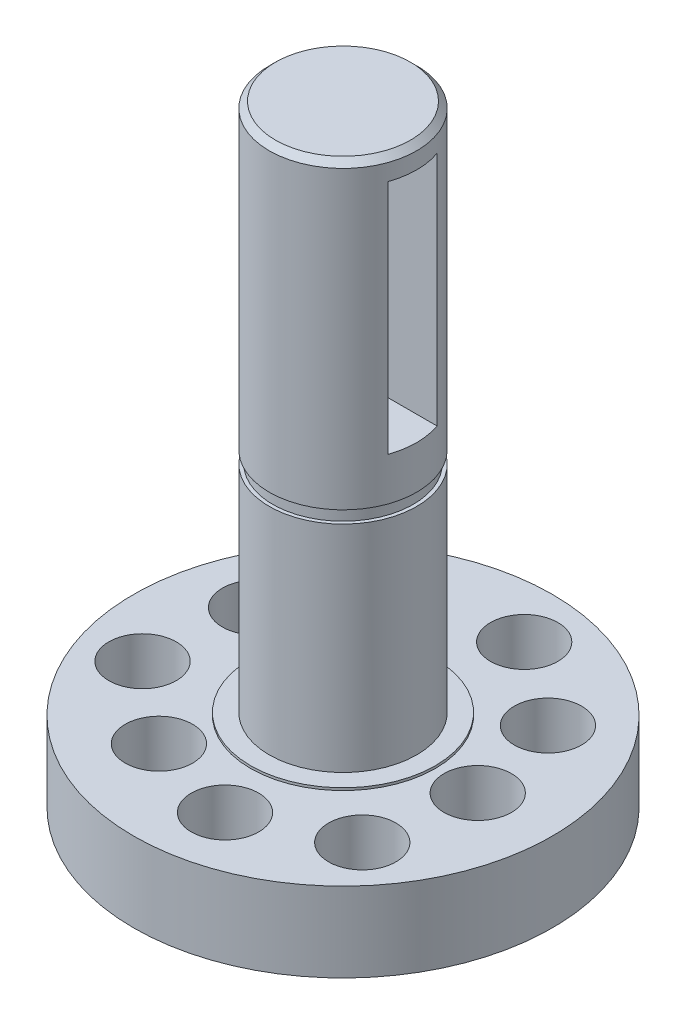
ISO-10303-21;
HEADER;
FILE_DESCRIPTION(('STEP AP214'),'2;1');
FILE_NAME('part.step','',(''),(''),'','','');
FILE_SCHEMA(('AUTOMOTIVE_DESIGN { 1 0 10303 214 1 1 1 1 }'));
ENDSEC;
DATA;
#1=APPLICATION_CONTEXT('core data for automotive mechanical design processes');
#2=APPLICATION_PROTOCOL_DEFINITION('international standard','automotive_design',2000,#1);
#3=PRODUCT_CONTEXT('',#1,'mechanical');
#4=PRODUCT('Part','Part','',(#3));
#5=PRODUCT_RELATED_PRODUCT_CATEGORY('part','',(#4));
#6=PRODUCT_DEFINITION_FORMATION('','',#4);
#7=PRODUCT_DEFINITION_CONTEXT('part definition',#1,'design');
#8=PRODUCT_DEFINITION('design','',#6,#7);
#9=PRODUCT_DEFINITION_SHAPE('','',#8);
#10=(LENGTH_UNIT() NAMED_UNIT(*) SI_UNIT(.MILLI.,.METRE.));
#11=(NAMED_UNIT(*) PLANE_ANGLE_UNIT() SI_UNIT($,.RADIAN.));
#12=(NAMED_UNIT(*) SI_UNIT($,.STERADIAN.) SOLID_ANGLE_UNIT());
#13=UNCERTAINTY_MEASURE_WITH_UNIT(LENGTH_MEASURE(1.E-05),#10,'distance_accuracy_value','');
#14=(GEOMETRIC_REPRESENTATION_CONTEXT(3) GLOBAL_UNCERTAINTY_ASSIGNED_CONTEXT((#13)) GLOBAL_UNIT_ASSIGNED_CONTEXT((#10,
#11,#12)) REPRESENTATION_CONTEXT('',''));
#15=CARTESIAN_POINT('',(0.,0.,0.));
#16=DIRECTION('',(0.,0.,1.));
#17=DIRECTION('',(1.,0.,0.));
#18=AXIS2_PLACEMENT_3D('',#15,#16,#17);
#19=CARTESIAN_POINT('',(0.,49.64,0.));
#20=DIRECTION('',(0.,-1.,0.));
#21=DIRECTION('',(0.,0.,-1.));
#22=AXIS2_PLACEMENT_3D('',#19,#20,#21);
#23=CYLINDRICAL_SURFACE('',#22,5.985);
#24=CARTESIAN_POINT('',(0.,25.13,0.));
#25=DIRECTION('',(0.,1.,0.));
#26=DIRECTION('',(0.,0.,1.));
#27=AXIS2_PLACEMENT_3D('',#24,#25,#26);
#28=CIRCLE('',#27,5.985);
#29=CARTESIAN_POINT('',(0.,25.13,5.985));
#30=VERTEX_POINT('',#29);
#31=EDGE_CURVE('E136',#30,#30,#28,.T.);
#32=ORIENTED_EDGE('',*,*,#31,.T.);
#33=EDGE_LOOP('',(#32));
#34=FACE_BOUND('',#33,.T.);
#35=CARTESIAN_POINT('',(0.,49.14,0.));
#36=DIRECTION('',(0.,1.,0.));
#37=DIRECTION('',(0.,0.,1.));
#38=AXIS2_PLACEMENT_3D('',#35,#36,#37);
#39=CIRCLE('',#38,5.985);
#40=CARTESIAN_POINT('',(0.,49.14,5.985));
#41=VERTEX_POINT('',#40);
#42=EDGE_CURVE('E166',#41,#41,#39,.F.);
#43=ORIENTED_EDGE('',*,*,#42,.T.);
#44=EDGE_LOOP('',(#43));
#45=FACE_BOUND('',#44,.T.);
#46=DIRECTION('',(0.,-1.,0.));
#47=VECTOR('',#46,1.);
#48=CARTESIAN_POINT('',(5.64310090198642,49.64,1.99390000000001));
#49=LINE('',#48,#47);
#50=CARTESIAN_POINT('',(5.64310090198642,47.7985,1.99390000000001));
#51=VERTEX_POINT('',#50);
#52=CARTESIAN_POINT('',(5.64310090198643,28.6215,1.9939));
#53=VERTEX_POINT('',#52);
#54=EDGE_CURVE('E11',#51,#53,#49,.T.);
#55=ORIENTED_EDGE('',*,*,#54,.F.);
#56=CARTESIAN_POINT('',(0.,47.7985,0.));
#57=DIRECTION('',(0.,-1.,0.));
#58=DIRECTION('',(0.,0.,-1.));
#59=AXIS2_PLACEMENT_3D('',#56,#57,#58);
#60=CIRCLE('',#59,5.985);
#61=CARTESIAN_POINT('',(5.64310090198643,47.7985,-1.99389999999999));
#62=VERTEX_POINT('',#61);
#63=EDGE_CURVE('E223',#62,#51,#60,.T.);
#64=ORIENTED_EDGE('',*,*,#63,.F.);
#65=DIRECTION('',(0.,-1.,0.));
#66=VECTOR('',#65,1.);
#67=CARTESIAN_POINT('',(5.64310090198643,49.64,-1.99389999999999));
#68=LINE('',#67,#66);
#69=CARTESIAN_POINT('',(5.64310090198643,28.6215,-1.9939));
#70=VERTEX_POINT('',#69);
#71=EDGE_CURVE('E225',#70,#62,#68,.F.);
#72=ORIENTED_EDGE('',*,*,#71,.F.);
#73=CARTESIAN_POINT('',(0.,28.6215,0.));
#74=DIRECTION('',(0.,1.,0.));
#75=DIRECTION('',(0.,0.,1.));
#76=AXIS2_PLACEMENT_3D('',#73,#74,#75);
#77=CIRCLE('',#76,5.985);
#78=EDGE_CURVE('E44',#53,#70,#77,.T.);
#79=ORIENTED_EDGE('',*,*,#78,.F.);
#80=EDGE_LOOP('',(#55,#64,#72,#79));
#81=FACE_BOUND('',#80,.T.);
#82=ADVANCED_FACE('F36',(#34,#45,#81),#23,.T.);
#83=CARTESIAN_POINT('',(0.,24.13,0.));
#84=DIRECTION('',(0.,-1.,0.));
#85=DIRECTION('',(0.,0.,-1.));
#86=AXIS2_PLACEMENT_3D('',#83,#84,#85);
#87=CIRCLE('',#86,5.985);
#88=CARTESIAN_POINT('',(0.,24.13,-5.985));
#89=VERTEX_POINT('',#88);
#90=EDGE_CURVE('E141',#89,#89,#87,.T.);
#91=ORIENTED_EDGE('',*,*,#90,.T.);
#92=EDGE_LOOP('',(#91));
#93=FACE_BOUND('',#92,.T.);
#94=CARTESIAN_POINT('',(0.,6.66,0.));
#95=DIRECTION('',(0.,1.,0.));
#96=DIRECTION('',(0.,0.,1.));
#97=AXIS2_PLACEMENT_3D('',#94,#95,#96);
#98=CIRCLE('',#97,5.985);
#99=CARTESIAN_POINT('',(0.,6.66,5.985));
#100=VERTEX_POINT('',#99);
#101=EDGE_CURVE('E144',#100,#100,#98,.T.);
#102=ORIENTED_EDGE('',*,*,#101,.T.);
#103=EDGE_LOOP('',(#102));
#104=FACE_BOUND('',#103,.T.);
#105=ADVANCED_FACE('F241',(#93,#104),#23,.T.);
#106=CARTESIAN_POINT('',(0.,6.46,0.));
#107=DIRECTION('',(0.,1.,0.));
#108=DIRECTION('',(0.,0.,1.));
#109=AXIS2_PLACEMENT_3D('',#106,#107,#108);
#110=PLANE('',#109);
#111=CARTESIAN_POINT('',(2.20533185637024,6.46,-12.507058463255));
#112=DIRECTION('',(0.,1.,0.));
#113=DIRECTION('',(0.,0.,1.));
#114=AXIS2_PLACEMENT_3D('',#111,#112,#113);
#115=CIRCLE('',#114,2.73685);
#116=CARTESIAN_POINT('',(2.20533185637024,6.46,-9.770208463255));
#117=VERTEX_POINT('',#116);
#118=EDGE_CURVE('E81',#117,#117,#115,.T.);
#119=ORIENTED_EDGE('',*,*,#118,.F.);
#120=EDGE_LOOP('',(#119));
#121=FACE_BOUND('',#120,.T.);
#122=CARTESIAN_POINT('',(-11.9340962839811,6.46,4.34365582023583));
#123=DIRECTION('',(0.,1.,0.));
#124=DIRECTION('',(0.,0.,1.));
#125=AXIS2_PLACEMENT_3D('',#122,#123,#124);
#126=CIRCLE('',#125,2.73685);
#127=CARTESIAN_POINT('',(-11.9340962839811,6.46,7.08050582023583));
#128=VERTEX_POINT('',#127);
#129=EDGE_CURVE('E106',#128,#128,#126,.T.);
#130=ORIENTED_EDGE('',*,*,#129,.F.);
#131=EDGE_LOOP('',(#130));
#132=FACE_BOUND('',#131,.T.);
#133=CARTESIAN_POINT('',(9.72876442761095,6.46,8.16340264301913));
#134=DIRECTION('',(0.,1.,0.));
#135=DIRECTION('',(0.,0.,1.));
#136=AXIS2_PLACEMENT_3D('',#133,#134,#135);
#137=CIRCLE('',#136,2.73685);
#138=CARTESIAN_POINT('',(9.72876442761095,6.46,10.9002526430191));
#139=VERTEX_POINT('',#138);
#140=EDGE_CURVE('E109',#139,#139,#137,.T.);
#141=ORIENTED_EDGE('',*,*,#140,.F.);
#142=EDGE_LOOP('',(#141));
#143=FACE_BOUND('',#142,.T.);
#144=CARTESIAN_POINT('',(9.04775091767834,6.46,-7.59196445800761));
#145=DIRECTION('',(0.,1.,0.));
#146=DIRECTION('',(0.,0.,1.));
#147=AXIS2_PLACEMENT_3D('',#144,#145,#146);
#148=CIRCLE('',#147,2.73685);
#149=CARTESIAN_POINT('',(9.04775091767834,6.46,-4.85511445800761));
#150=VERTEX_POINT('',#149);
#151=EDGE_CURVE('E112',#150,#150,#148,.T.);
#152=ORIENTED_EDGE('',*,*,#151,.F.);
#153=EDGE_LOOP('',(#152));
#154=FACE_BOUND('',#153,.T.);
#155=CARTESIAN_POINT('',(-11.0987095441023,6.46,-4.03959991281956));
#156=DIRECTION('',(0.,1.,0.));
#157=DIRECTION('',(0.,0.,1.));
#158=AXIS2_PLACEMENT_3D('',#155,#156,#157);
#159=CIRCLE('',#158,2.73685);
#160=CARTESIAN_POINT('',(-11.0987095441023,6.46,-1.30274991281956));
#161=VERTEX_POINT('',#160);
#162=EDGE_CURVE('E115',#161,#161,#159,.T.);
#163=ORIENTED_EDGE('',*,*,#162,.F.);
#164=EDGE_LOOP('',(#163));
#165=FACE_BOUND('',#164,.T.);
#166=CARTESIAN_POINT('',(2.05095862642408,6.46,11.6315643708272));
#167=DIRECTION('',(0.,1.,0.));
#168=DIRECTION('',(0.,0.,1.));
#169=AXIS2_PLACEMENT_3D('',#166,#167,#168);
#170=CIRCLE('',#169,2.73685);
#171=CARTESIAN_POINT('',(2.05095862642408,6.46,14.3684143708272));
#172=VERTEX_POINT('',#171);
#173=EDGE_CURVE('E118',#172,#172,#170,.T.);
#174=ORIENTED_EDGE('',*,*,#173,.F.);
#175=EDGE_LOOP('',(#174));
#176=FACE_BOUND('',#175,.T.);
#177=CARTESIAN_POINT('',(-5.47052499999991,6.46,-9.47522724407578));
#178=DIRECTION('',(0.,1.,0.));
#179=DIRECTION('',(0.,0.,1.));
#180=AXIS2_PLACEMENT_3D('',#177,#178,#179);
#181=CIRCLE('',#180,2.73685);
#182=CARTESIAN_POINT('',(-5.47052499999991,6.46,-6.73837724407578));
#183=VERTEX_POINT('',#182);
#184=EDGE_CURVE('E121',#183,#183,#181,.T.);
#185=ORIENTED_EDGE('',*,*,#184,.F.);
#186=EDGE_LOOP('',(#185));
#187=FACE_BOUND('',#186,.T.);
#188=CARTESIAN_POINT('',(-5.47052500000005,6.46,9.47522724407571));
#189=DIRECTION('',(0.,1.,0.));
#190=DIRECTION('',(0.,0.,1.));
#191=AXIS2_PLACEMENT_3D('',#188,#189,#190);
#192=CIRCLE('',#191,2.73685);
#193=CARTESIAN_POINT('',(-5.47052500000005,6.46,12.2120772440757));
#194=VERTEX_POINT('',#193);
#195=EDGE_CURVE('E124',#194,#194,#192,.T.);
#196=ORIENTED_EDGE('',*,*,#195,.F.);
#197=EDGE_LOOP('',(#196));
#198=FACE_BOUND('',#197,.T.);
#199=CARTESIAN_POINT('',(10.94105,6.46,0.));
#200=DIRECTION('',(0.,1.,0.));
#201=DIRECTION('',(0.,0.,1.));
#202=AXIS2_PLACEMENT_3D('',#199,#200,#201);
#203=CIRCLE('',#202,2.73685);
#204=CARTESIAN_POINT('',(10.94105,6.46,2.73685));
#205=VERTEX_POINT('',#204);
#206=EDGE_CURVE('E127',#205,#205,#203,.T.);
#207=ORIENTED_EDGE('',*,*,#206,.F.);
#208=EDGE_LOOP('',(#207));
#209=FACE_BOUND('',#208,.T.);
#210=CARTESIAN_POINT('',(0.,6.46,0.));
#211=DIRECTION('',(0.,1.,0.));
#212=DIRECTION('',(0.,0.,1.));
#213=AXIS2_PLACEMENT_3D('',#210,#211,#212);
#214=CIRCLE('',#213,17.);
#215=CARTESIAN_POINT('',(0.,6.46,17.));
#216=VERTEX_POINT('',#215);
#217=EDGE_CURVE('E154',#216,#216,#214,.T.);
#218=ORIENTED_EDGE('',*,*,#217,.T.);
#219=EDGE_LOOP('',(#218));
#220=FACE_BOUND('',#219,.T.);
#221=CARTESIAN_POINT('',(0.,6.46,0.));
#222=DIRECTION('',(0.,1.,0.));
#223=DIRECTION('',(0.,0.,1.));
#224=AXIS2_PLACEMENT_3D('',#221,#222,#223);
#225=CIRCLE('',#224,7.5);
#226=CARTESIAN_POINT('',(0.,6.46,7.5));
#227=VERTEX_POINT('',#226);
#228=EDGE_CURVE('E137',#227,#227,#225,.T.);
#229=ORIENTED_EDGE('',*,*,#228,.F.);
#230=EDGE_LOOP('',(#229));
#231=FACE_BOUND('',#230,.T.);
#232=ADVANCED_FACE('F247',(#121,#132,#143,#154,#165,#176,#187,#198,#209,#220,#231),#110,.T.);
#233=CARTESIAN_POINT('',(0.,6.46,0.));
#234=DIRECTION('',(0.,-1.,0.));
#235=DIRECTION('',(0.,0.,-1.));
#236=AXIS2_PLACEMENT_3D('',#233,#234,#235);
#237=CYLINDRICAL_SURFACE('',#236,17.);
#238=ORIENTED_EDGE('',*,*,#217,.F.);
#239=EDGE_LOOP('',(#238));
#240=FACE_BOUND('',#239,.T.);
#241=CARTESIAN_POINT('',(0.,0.,0.));
#242=DIRECTION('',(0.,1.,0.));
#243=DIRECTION('',(0.,0.,1.));
#244=AXIS2_PLACEMENT_3D('',#241,#242,#243);
#245=CIRCLE('',#244,17.);
#246=CARTESIAN_POINT('',(0.,0.,17.));
#247=VERTEX_POINT('',#246);
#248=EDGE_CURVE('E151',#247,#247,#245,.T.);
#249=ORIENTED_EDGE('',*,*,#248,.T.);
#250=EDGE_LOOP('',(#249));
#251=FACE_BOUND('',#250,.T.);
#252=ADVANCED_FACE('F38',(#240,#251),#237,.T.);
#253=CARTESIAN_POINT('',(0.,0.,0.));
#254=DIRECTION('',(0.,1.,0.));
#255=DIRECTION('',(0.,0.,1.));
#256=AXIS2_PLACEMENT_3D('',#253,#254,#255);
#257=PLANE('',#256);
#258=CARTESIAN_POINT('',(-11.0987095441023,0.,-4.03959991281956));
#259=DIRECTION('',(0.,1.,0.));
#260=DIRECTION('',(0.,0.,1.));
#261=AXIS2_PLACEMENT_3D('',#258,#259,#260);
#262=CIRCLE('',#261,2.99084999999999);
#263=CARTESIAN_POINT('',(-11.0987095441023,0.,-1.04874991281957));
#264=VERTEX_POINT('',#263);
#265=EDGE_CURVE('E196',#264,#264,#262,.T.);
#266=ORIENTED_EDGE('',*,*,#265,.T.);
#267=EDGE_LOOP('',(#266));
#268=FACE_BOUND('',#267,.T.);
#269=CARTESIAN_POINT('',(-5.47052499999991,0.,-9.47522724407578));
#270=DIRECTION('',(0.,1.,0.));
#271=DIRECTION('',(0.,0.,1.));
#272=AXIS2_PLACEMENT_3D('',#269,#270,#271);
#273=CIRCLE('',#272,2.99085000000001);
#274=CARTESIAN_POINT('',(-5.47052499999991,0.,-6.48437724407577));
#275=VERTEX_POINT('',#274);
#276=EDGE_CURVE('E193',#275,#275,#273,.T.);
#277=ORIENTED_EDGE('',*,*,#276,.T.);
#278=EDGE_LOOP('',(#277));
#279=FACE_BOUND('',#278,.T.);
#280=CARTESIAN_POINT('',(2.20533185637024,0.,-12.507058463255));
#281=DIRECTION('',(0.,1.,0.));
#282=DIRECTION('',(0.,0.,1.));
#283=AXIS2_PLACEMENT_3D('',#280,#281,#282);
#284=CIRCLE('',#283,2.99085000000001);
#285=CARTESIAN_POINT('',(2.20533185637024,0.,-9.516208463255));
#286=VERTEX_POINT('',#285);
#287=EDGE_CURVE('E190',#286,#286,#284,.T.);
#288=ORIENTED_EDGE('',*,*,#287,.T.);
#289=EDGE_LOOP('',(#288));
#290=FACE_BOUND('',#289,.T.);
#291=CARTESIAN_POINT('',(9.04775091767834,0.,-7.59196445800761));
#292=DIRECTION('',(0.,1.,0.));
#293=DIRECTION('',(0.,0.,1.));
#294=AXIS2_PLACEMENT_3D('',#291,#292,#293);
#295=CIRCLE('',#294,2.99085000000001);
#296=CARTESIAN_POINT('',(9.04775091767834,0.,-4.6011144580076));
#297=VERTEX_POINT('',#296);
#298=EDGE_CURVE('E187',#297,#297,#295,.T.);
#299=ORIENTED_EDGE('',*,*,#298,.T.);
#300=EDGE_LOOP('',(#299));
#301=FACE_BOUND('',#300,.T.);
#302=CARTESIAN_POINT('',(10.94105,0.,0.));
#303=DIRECTION('',(0.,1.,0.));
#304=DIRECTION('',(0.,0.,1.));
#305=AXIS2_PLACEMENT_3D('',#302,#303,#304);
#306=CIRCLE('',#305,2.99084999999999);
#307=CARTESIAN_POINT('',(10.94105,0.,2.99084999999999));
#308=VERTEX_POINT('',#307);
#309=EDGE_CURVE('E184',#308,#308,#306,.T.);
#310=ORIENTED_EDGE('',*,*,#309,.T.);
#311=EDGE_LOOP('',(#310));
#312=FACE_BOUND('',#311,.T.);
#313=CARTESIAN_POINT('',(9.72876442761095,0.,8.16340264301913));
#314=DIRECTION('',(0.,1.,0.));
#315=DIRECTION('',(0.,0.,1.));
#316=AXIS2_PLACEMENT_3D('',#313,#314,#315);
#317=CIRCLE('',#316,2.99084999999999);
#318=CARTESIAN_POINT('',(9.72876442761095,0.,11.1542526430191));
#319=VERTEX_POINT('',#318);
#320=EDGE_CURVE('E181',#319,#319,#317,.T.);
#321=ORIENTED_EDGE('',*,*,#320,.T.);
#322=EDGE_LOOP('',(#321));
#323=FACE_BOUND('',#322,.T.);
#324=CARTESIAN_POINT('',(2.05095862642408,0.,11.6315643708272));
#325=DIRECTION('',(0.,1.,0.));
#326=DIRECTION('',(0.,0.,1.));
#327=AXIS2_PLACEMENT_3D('',#324,#325,#326);
#328=CIRCLE('',#327,2.99084999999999);
#329=CARTESIAN_POINT('',(2.05095862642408,0.,14.6224143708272));
#330=VERTEX_POINT('',#329);
#331=EDGE_CURVE('E178',#330,#330,#328,.T.);
#332=ORIENTED_EDGE('',*,*,#331,.T.);
#333=EDGE_LOOP('',(#332));
#334=FACE_BOUND('',#333,.T.);
#335=CARTESIAN_POINT('',(-5.47052500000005,0.,9.47522724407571));
#336=DIRECTION('',(0.,1.,0.));
#337=DIRECTION('',(0.,0.,1.));
#338=AXIS2_PLACEMENT_3D('',#335,#336,#337);
#339=CIRCLE('',#338,2.99085000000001);
#340=CARTESIAN_POINT('',(-5.47052500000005,0.,12.4660772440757));
#341=VERTEX_POINT('',#340);
#342=EDGE_CURVE('E175',#341,#341,#339,.T.);
#343=ORIENTED_EDGE('',*,*,#342,.T.);
#344=EDGE_LOOP('',(#343));
#345=FACE_BOUND('',#344,.T.);
#346=CARTESIAN_POINT('',(-11.9340962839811,0.,4.34365582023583));
#347=DIRECTION('',(0.,1.,0.));
#348=DIRECTION('',(0.,0.,1.));
#349=AXIS2_PLACEMENT_3D('',#346,#347,#348);
#350=CIRCLE('',#349,2.99084999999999);
#351=CARTESIAN_POINT('',(-11.9340962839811,0.,7.33450582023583));
#352=VERTEX_POINT('',#351);
#353=EDGE_CURVE('E172',#352,#352,#350,.T.);
#354=ORIENTED_EDGE('',*,*,#353,.T.);
#355=EDGE_LOOP('',(#354));
#356=FACE_BOUND('',#355,.T.);
#357=CARTESIAN_POINT('',(0.,0.,0.));
#358=DIRECTION('',(0.,-1.,0.));
#359=DIRECTION('',(0.,0.,-1.));
#360=AXIS2_PLACEMENT_3D('',#357,#358,#359);
#361=CIRCLE('',#360,7.25);
#362=CARTESIAN_POINT('',(0.,0.,-7.25));
#363=VERTEX_POINT('',#362);
#364=EDGE_CURVE('E145',#363,#363,#361,.T.);
#365=ORIENTED_EDGE('',*,*,#364,.F.);
#366=EDGE_LOOP('',(#365));
#367=FACE_BOUND('',#366,.T.);
#368=ORIENTED_EDGE('',*,*,#248,.F.);
#369=EDGE_LOOP('',(#368));
#370=FACE_BOUND('',#369,.T.);
#371=ADVANCED_FACE('F262',(#268,#279,#290,#301,#312,#323,#334,#345,#356,#367,#370),#257,.F.);
#372=CARTESIAN_POINT('',(0.,2.,0.));
#373=DIRECTION('',(0.,-1.,0.));
#374=DIRECTION('',(0.,0.,-1.));
#375=AXIS2_PLACEMENT_3D('',#372,#373,#374);
#376=CYLINDRICAL_SURFACE('',#375,7.25);
#377=CARTESIAN_POINT('',(0.,2.,0.));
#378=DIRECTION('',(0.,-1.,0.));
#379=DIRECTION('',(0.,0.,-1.));
#380=AXIS2_PLACEMENT_3D('',#377,#378,#379);
#381=CIRCLE('',#380,7.25);
#382=CARTESIAN_POINT('',(0.,2.,-7.25));
#383=VERTEX_POINT('',#382);
#384=EDGE_CURVE('E148',#383,#383,#381,.T.);
#385=ORIENTED_EDGE('',*,*,#384,.F.);
#386=EDGE_LOOP('',(#385));
#387=FACE_BOUND('',#386,.T.);
#388=ORIENTED_EDGE('',*,*,#364,.T.);
#389=EDGE_LOOP('',(#388));
#390=FACE_BOUND('',#389,.T.);
#391=ADVANCED_FACE('F258',(#387,#390),#376,.F.);
#392=CARTESIAN_POINT('',(0.,2.,0.));
#393=DIRECTION('',(0.,-1.,0.));
#394=DIRECTION('',(0.,0.,-1.));
#395=AXIS2_PLACEMENT_3D('',#392,#393,#394);
#396=PLANE('',#395);
#397=ORIENTED_EDGE('',*,*,#384,.T.);
#398=EDGE_LOOP('',(#397));
#399=FACE_BOUND('',#398,.T.);
#400=ADVANCED_FACE('F254',(#399),#396,.T.);
#401=CARTESIAN_POINT('',(0.,6.66,0.));
#402=DIRECTION('',(0.,1.,0.));
#403=DIRECTION('',(0.,0.,1.));
#404=AXIS2_PLACEMENT_3D('',#401,#402,#403);
#405=PLANE('',#404);
#406=CARTESIAN_POINT('',(0.,6.66,0.));
#407=DIRECTION('',(0.,1.,0.));
#408=DIRECTION('',(0.,0.,1.));
#409=AXIS2_PLACEMENT_3D('',#406,#407,#408);
#410=CIRCLE('',#409,7.5);
#411=CARTESIAN_POINT('',(0.,6.66,7.5));
#412=VERTEX_POINT('',#411);
#413=EDGE_CURVE('E140',#412,#412,#410,.T.);
#414=ORIENTED_EDGE('',*,*,#413,.T.);
#415=EDGE_LOOP('',(#414));
#416=FACE_BOUND('',#415,.T.);
#417=ORIENTED_EDGE('',*,*,#101,.F.);
#418=EDGE_LOOP('',(#417));
#419=FACE_BOUND('',#418,.T.);
#420=ADVANCED_FACE('F257',(#416,#419),#405,.T.);
#421=CARTESIAN_POINT('',(0.,6.66,0.));
#422=DIRECTION('',(0.,-1.,0.));
#423=DIRECTION('',(0.,0.,-1.));
#424=AXIS2_PLACEMENT_3D('',#421,#422,#423);
#425=CYLINDRICAL_SURFACE('',#424,7.5);
#426=ORIENTED_EDGE('',*,*,#413,.F.);
#427=EDGE_LOOP('',(#426));
#428=FACE_BOUND('',#427,.T.);
#429=ORIENTED_EDGE('',*,*,#228,.T.);
#430=EDGE_LOOP('',(#429));
#431=FACE_BOUND('',#430,.T.);
#432=ADVANCED_FACE('F294',(#428,#431),#425,.T.);
#433=CARTESIAN_POINT('',(0.,24.13,-5.7));
#434=DIRECTION('',(0.,-1.,0.));
#435=DIRECTION('',(0.,0.,-1.));
#436=AXIS2_PLACEMENT_3D('',#433,#434,#435);
#437=PLANE('',#436);
#438=CARTESIAN_POINT('',(0.,24.13,0.));
#439=DIRECTION('',(0.,-1.,0.));
#440=DIRECTION('',(0.,0.,-1.));
#441=AXIS2_PLACEMENT_3D('',#438,#439,#440);
#442=CIRCLE('',#441,5.7);
#443=CARTESIAN_POINT('',(0.,24.13,-5.7));
#444=VERTEX_POINT('',#443);
#445=EDGE_CURVE('E133',#444,#444,#442,.T.);
#446=ORIENTED_EDGE('',*,*,#445,.T.);
#447=EDGE_LOOP('',(#446));
#448=FACE_BOUND('',#447,.T.);
#449=ORIENTED_EDGE('',*,*,#90,.F.);
#450=EDGE_LOOP('',(#449));
#451=FACE_BOUND('',#450,.T.);
#452=ADVANCED_FACE('F296',(#448,#451),#437,.F.);
#453=CARTESIAN_POINT('',(0.,25.13,-5.7));
#454=DIRECTION('',(0.,1.,0.));
#455=DIRECTION('',(0.,0.,1.));
#456=AXIS2_PLACEMENT_3D('',#453,#454,#455);
#457=PLANE('',#456);
#458=CARTESIAN_POINT('',(0.,25.13,0.));
#459=DIRECTION('',(0.,-1.,0.));
#460=DIRECTION('',(0.,0.,-1.));
#461=AXIS2_PLACEMENT_3D('',#458,#459,#460);
#462=CIRCLE('',#461,5.7);
#463=CARTESIAN_POINT('',(0.,25.13,-5.7));
#464=VERTEX_POINT('',#463);
#465=EDGE_CURVE('E130',#464,#464,#462,.T.);
#466=ORIENTED_EDGE('',*,*,#465,.F.);
#467=EDGE_LOOP('',(#466));
#468=FACE_BOUND('',#467,.T.);
#469=ORIENTED_EDGE('',*,*,#31,.F.);
#470=EDGE_LOOP('',(#469));
#471=FACE_BOUND('',#470,.T.);
#472=ADVANCED_FACE('F302',(#468,#471),#457,.F.);
#473=CARTESIAN_POINT('',(0.,0.,0.));
#474=DIRECTION('',(0.,-1.,0.));
#475=DIRECTION('',(0.,0.,-1.));
#476=AXIS2_PLACEMENT_3D('',#473,#474,#475);
#477=CYLINDRICAL_SURFACE('',#476,5.7);
#478=ORIENTED_EDGE('',*,*,#445,.F.);
#479=EDGE_LOOP('',(#478));
#480=FACE_BOUND('',#479,.T.);
#481=ORIENTED_EDGE('',*,*,#465,.T.);
#482=EDGE_LOOP('',(#481));
#483=FACE_BOUND('',#482,.T.);
#484=ADVANCED_FACE('F309',(#480,#483),#477,.T.);
#485=CARTESIAN_POINT('',(0.,49.64,0.));
#486=DIRECTION('',(0.,1.,0.));
#487=DIRECTION('',(0.,0.,1.));
#488=AXIS2_PLACEMENT_3D('',#485,#486,#487);
#489=PLANE('',#488);
#490=CARTESIAN_POINT('',(0.,49.64,0.));
#491=DIRECTION('',(0.,1.,0.));
#492=DIRECTION('',(0.,0.,1.));
#493=AXIS2_PLACEMENT_3D('',#490,#491,#492);
#494=CIRCLE('',#493,5.485);
#495=CARTESIAN_POINT('',(0.,49.64,5.485));
#496=VERTEX_POINT('',#495);
#497=EDGE_CURVE('E157',#496,#496,#494,.T.);
#498=ORIENTED_EDGE('',*,*,#497,.T.);
#499=EDGE_LOOP('',(#498));
#500=FACE_BOUND('',#499,.T.);
#501=ADVANCED_FACE('F252',(#500),#489,.T.);
#502=CARTESIAN_POINT('',(10.94105,49.64,0.));
#503=DIRECTION('',(0.,-1.,0.));
#504=DIRECTION('',(0.,0.,-1.));
#505=AXIS2_PLACEMENT_3D('',#502,#503,#504);
#506=CYLINDRICAL_SURFACE('',#505,2.73685);
#507=CARTESIAN_POINT('',(10.94105,0.092448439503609,0.));
#508=DIRECTION('',(0.,1.,0.));
#509=DIRECTION('',(0.,0.,1.));
#510=AXIS2_PLACEMENT_3D('',#507,#508,#509);
#511=CIRCLE('',#510,2.73685);
#512=CARTESIAN_POINT('',(10.94105,0.092448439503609,2.73685));
#513=VERTEX_POINT('',#512);
#514=EDGE_CURVE('E208',#513,#513,#511,.F.);
#515=ORIENTED_EDGE('',*,*,#514,.T.);
#516=EDGE_LOOP('',(#515));
#517=FACE_BOUND('',#516,.T.);
#518=ORIENTED_EDGE('',*,*,#206,.T.);
#519=EDGE_LOOP('',(#518));
#520=FACE_BOUND('',#519,.T.);
#521=ADVANCED_FACE('F316',(#517,#520),#506,.F.);
#522=CARTESIAN_POINT('',(0.,49.64,0.));
#523=DIRECTION('',(0.,-1.,0.));
#524=DIRECTION('',(0.,0.,-1.));
#525=AXIS2_PLACEMENT_3D('',#522,#523,#524);
#526=CONICAL_SURFACE('',#525,5.485,0.785398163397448);
#527=ORIENTED_EDGE('',*,*,#42,.F.);
#528=EDGE_LOOP('',(#527));
#529=FACE_BOUND('',#528,.T.);
#530=ORIENTED_EDGE('',*,*,#497,.F.);
#531=EDGE_LOOP('',(#530));
#532=FACE_BOUND('',#531,.T.);
#533=ADVANCED_FACE('F319',(#529,#532),#526,.T.);
#534=CARTESIAN_POINT('',(-5.47052500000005,49.64,9.47522724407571));
#535=DIRECTION('',(0.,-1.,0.));
#536=DIRECTION('',(0.,0.,-1.));
#537=AXIS2_PLACEMENT_3D('',#534,#535,#536);
#538=CYLINDRICAL_SURFACE('',#537,2.73685);
#539=CARTESIAN_POINT('',(-5.47052500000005,0.092448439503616,9.47522724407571));
#540=DIRECTION('',(0.,1.,0.));
#541=DIRECTION('',(0.,0.,1.));
#542=AXIS2_PLACEMENT_3D('',#539,#540,#541);
#543=CIRCLE('',#542,2.73685);
#544=CARTESIAN_POINT('',(-5.47052500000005,0.092448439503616,12.2120772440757));
#545=VERTEX_POINT('',#544);
#546=EDGE_CURVE('E217',#545,#545,#543,.F.);
#547=ORIENTED_EDGE('',*,*,#546,.T.);
#548=EDGE_LOOP('',(#547));
#549=FACE_BOUND('',#548,.T.);
#550=ORIENTED_EDGE('',*,*,#195,.T.);
#551=EDGE_LOOP('',(#550));
#552=FACE_BOUND('',#551,.T.);
#553=ADVANCED_FACE('F323',(#549,#552),#538,.F.);
#554=CARTESIAN_POINT('',(-5.47052499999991,49.64,-9.47522724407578));
#555=DIRECTION('',(0.,-1.,0.));
#556=DIRECTION('',(0.,0.,-1.));
#557=AXIS2_PLACEMENT_3D('',#554,#555,#556);
#558=CYLINDRICAL_SURFACE('',#557,2.73685);
#559=CARTESIAN_POINT('',(-5.47052499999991,0.092448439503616,-9.47522724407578));
#560=DIRECTION('',(0.,1.,0.));
#561=DIRECTION('',(0.,0.,1.));
#562=AXIS2_PLACEMENT_3D('',#559,#560,#561);
#563=CIRCLE('',#562,2.73685);
#564=CARTESIAN_POINT('',(-5.47052499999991,0.092448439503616,-6.73837724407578));
#565=VERTEX_POINT('',#564);
#566=EDGE_CURVE('E199',#565,#565,#563,.F.);
#567=ORIENTED_EDGE('',*,*,#566,.T.);
#568=EDGE_LOOP('',(#567));
#569=FACE_BOUND('',#568,.T.);
#570=ORIENTED_EDGE('',*,*,#184,.T.);
#571=EDGE_LOOP('',(#570));
#572=FACE_BOUND('',#571,.T.);
#573=ADVANCED_FACE('F327',(#569,#572),#558,.F.);
#574=CARTESIAN_POINT('',(2.05095862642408,49.64,11.6315643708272));
#575=DIRECTION('',(0.,-1.,0.));
#576=DIRECTION('',(0.,0.,-1.));
#577=AXIS2_PLACEMENT_3D('',#574,#575,#576);
#578=CYLINDRICAL_SURFACE('',#577,2.73685);
#579=CARTESIAN_POINT('',(2.05095862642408,0.092448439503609,11.6315643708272));
#580=DIRECTION('',(0.,1.,0.));
#581=DIRECTION('',(0.,0.,1.));
#582=AXIS2_PLACEMENT_3D('',#579,#580,#581);
#583=CIRCLE('',#582,2.73685);
#584=CARTESIAN_POINT('',(2.05095862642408,0.092448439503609,14.3684143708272));
#585=VERTEX_POINT('',#584);
#586=EDGE_CURVE('E214',#585,#585,#583,.F.);
#587=ORIENTED_EDGE('',*,*,#586,.T.);
#588=EDGE_LOOP('',(#587));
#589=FACE_BOUND('',#588,.T.);
#590=ORIENTED_EDGE('',*,*,#173,.T.);
#591=EDGE_LOOP('',(#590));
#592=FACE_BOUND('',#591,.T.);
#593=ADVANCED_FACE('F331',(#589,#592),#578,.F.);
#594=CARTESIAN_POINT('',(-11.0987095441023,49.64,-4.03959991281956));
#595=DIRECTION('',(0.,-1.,0.));
#596=DIRECTION('',(0.,0.,-1.));
#597=AXIS2_PLACEMENT_3D('',#594,#595,#596);
#598=CYLINDRICAL_SURFACE('',#597,2.73685);
#599=CARTESIAN_POINT('',(-11.0987095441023,0.092448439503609,-4.03959991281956));
#600=DIRECTION('',(0.,1.,0.));
#601=DIRECTION('',(0.,0.,1.));
#602=AXIS2_PLACEMENT_3D('',#599,#600,#601);
#603=CIRCLE('',#602,2.73685);
#604=CARTESIAN_POINT('',(-11.0987095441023,0.092448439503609,-1.30274991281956));
#605=VERTEX_POINT('',#604);
#606=EDGE_CURVE('E169',#605,#605,#603,.F.);
#607=ORIENTED_EDGE('',*,*,#606,.T.);
#608=EDGE_LOOP('',(#607));
#609=FACE_BOUND('',#608,.T.);
#610=ORIENTED_EDGE('',*,*,#162,.T.);
#611=EDGE_LOOP('',(#610));
#612=FACE_BOUND('',#611,.T.);
#613=ADVANCED_FACE('F335',(#609,#612),#598,.F.);
#614=CARTESIAN_POINT('',(9.04775091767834,49.64,-7.59196445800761));
#615=DIRECTION('',(0.,-1.,0.));
#616=DIRECTION('',(0.,0.,-1.));
#617=AXIS2_PLACEMENT_3D('',#614,#615,#616);
#618=CYLINDRICAL_SURFACE('',#617,2.73685);
#619=CARTESIAN_POINT('',(9.04775091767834,0.092448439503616,-7.59196445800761));
#620=DIRECTION('',(0.,1.,0.));
#621=DIRECTION('',(0.,0.,1.));
#622=AXIS2_PLACEMENT_3D('',#619,#620,#621);
#623=CIRCLE('',#622,2.73685);
#624=CARTESIAN_POINT('',(9.04775091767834,0.092448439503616,-4.85511445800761));
#625=VERTEX_POINT('',#624);
#626=EDGE_CURVE('E205',#625,#625,#623,.F.);
#627=ORIENTED_EDGE('',*,*,#626,.T.);
#628=EDGE_LOOP('',(#627));
#629=FACE_BOUND('',#628,.T.);
#630=ORIENTED_EDGE('',*,*,#151,.T.);
#631=EDGE_LOOP('',(#630));
#632=FACE_BOUND('',#631,.T.);
#633=ADVANCED_FACE('F339',(#629,#632),#618,.F.);
#634=CARTESIAN_POINT('',(9.72876442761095,49.64,8.16340264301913));
#635=DIRECTION('',(0.,-1.,0.));
#636=DIRECTION('',(0.,0.,-1.));
#637=AXIS2_PLACEMENT_3D('',#634,#635,#636);
#638=CYLINDRICAL_SURFACE('',#637,2.73685);
#639=CARTESIAN_POINT('',(9.72876442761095,0.092448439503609,8.16340264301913));
#640=DIRECTION('',(0.,1.,0.));
#641=DIRECTION('',(0.,0.,1.));
#642=AXIS2_PLACEMENT_3D('',#639,#640,#641);
#643=CIRCLE('',#642,2.73685);
#644=CARTESIAN_POINT('',(9.72876442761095,0.092448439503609,10.9002526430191));
#645=VERTEX_POINT('',#644);
#646=EDGE_CURVE('E211',#645,#645,#643,.F.);
#647=ORIENTED_EDGE('',*,*,#646,.T.);
#648=EDGE_LOOP('',(#647));
#649=FACE_BOUND('',#648,.T.);
#650=ORIENTED_EDGE('',*,*,#140,.T.);
#651=EDGE_LOOP('',(#650));
#652=FACE_BOUND('',#651,.T.);
#653=ADVANCED_FACE('F343',(#649,#652),#638,.F.);
#654=CARTESIAN_POINT('',(-11.9340962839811,49.64,4.34365582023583));
#655=DIRECTION('',(0.,-1.,0.));
#656=DIRECTION('',(0.,0.,-1.));
#657=AXIS2_PLACEMENT_3D('',#654,#655,#656);
#658=CYLINDRICAL_SURFACE('',#657,2.73685);
#659=CARTESIAN_POINT('',(-11.9340962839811,0.092448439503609,4.34365582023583));
#660=DIRECTION('',(0.,1.,0.));
#661=DIRECTION('',(0.,0.,1.));
#662=AXIS2_PLACEMENT_3D('',#659,#660,#661);
#663=CIRCLE('',#662,2.73685);
#664=CARTESIAN_POINT('',(-11.9340962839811,0.092448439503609,7.08050582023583));
#665=VERTEX_POINT('',#664);
#666=EDGE_CURVE('E220',#665,#665,#663,.F.);
#667=ORIENTED_EDGE('',*,*,#666,.T.);
#668=EDGE_LOOP('',(#667));
#669=FACE_BOUND('',#668,.T.);
#670=ORIENTED_EDGE('',*,*,#129,.T.);
#671=EDGE_LOOP('',(#670));
#672=FACE_BOUND('',#671,.T.);
#673=ADVANCED_FACE('F347',(#669,#672),#658,.F.);
#674=CARTESIAN_POINT('',(2.20533185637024,49.64,-12.507058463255));
#675=DIRECTION('',(0.,-1.,0.));
#676=DIRECTION('',(0.,0.,-1.));
#677=AXIS2_PLACEMENT_3D('',#674,#675,#676);
#678=CYLINDRICAL_SURFACE('',#677,2.73685);
#679=CARTESIAN_POINT('',(2.20533185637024,0.092448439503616,-12.507058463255));
#680=DIRECTION('',(0.,1.,0.));
#681=DIRECTION('',(0.,0.,1.));
#682=AXIS2_PLACEMENT_3D('',#679,#680,#681);
#683=CIRCLE('',#682,2.73685);
#684=CARTESIAN_POINT('',(2.20533185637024,0.092448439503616,-9.770208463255));
#685=VERTEX_POINT('',#684);
#686=EDGE_CURVE('E202',#685,#685,#683,.F.);
#687=ORIENTED_EDGE('',*,*,#686,.T.);
#688=EDGE_LOOP('',(#687));
#689=FACE_BOUND('',#688,.T.);
#690=ORIENTED_EDGE('',*,*,#118,.T.);
#691=EDGE_LOOP('',(#690));
#692=FACE_BOUND('',#691,.T.);
#693=ADVANCED_FACE('F351',(#689,#692),#678,.F.);
#694=CARTESIAN_POINT('',(-11.0987095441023,0.092448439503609,-4.03959991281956));
#695=DIRECTION('',(0.,-1.,0.));
#696=DIRECTION('',(0.,0.,-1.));
#697=AXIS2_PLACEMENT_3D('',#694,#695,#696);
#698=CONICAL_SURFACE('',#697,2.73685,1.22173047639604);
#699=ORIENTED_EDGE('',*,*,#265,.F.);
#700=EDGE_LOOP('',(#699));
#701=FACE_BOUND('',#700,.T.);
#702=ORIENTED_EDGE('',*,*,#606,.F.);
#703=EDGE_LOOP('',(#702));
#704=FACE_BOUND('',#703,.T.);
#705=ADVANCED_FACE('F355',(#701,#704),#698,.F.);
#706=CARTESIAN_POINT('',(-5.47052499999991,0.092448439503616,-9.47522724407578));
#707=DIRECTION('',(0.,-1.,0.));
#708=DIRECTION('',(0.,0.,-1.));
#709=AXIS2_PLACEMENT_3D('',#706,#707,#708);
#710=CONICAL_SURFACE('',#709,2.73685,1.22173047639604);
#711=ORIENTED_EDGE('',*,*,#276,.F.);
#712=EDGE_LOOP('',(#711));
#713=FACE_BOUND('',#712,.T.);
#714=ORIENTED_EDGE('',*,*,#566,.F.);
#715=EDGE_LOOP('',(#714));
#716=FACE_BOUND('',#715,.T.);
#717=ADVANCED_FACE('F359',(#713,#716),#710,.F.);
#718=CARTESIAN_POINT('',(2.20533185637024,0.092448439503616,-12.507058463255));
#719=DIRECTION('',(0.,-1.,0.));
#720=DIRECTION('',(0.,0.,-1.));
#721=AXIS2_PLACEMENT_3D('',#718,#719,#720);
#722=CONICAL_SURFACE('',#721,2.73685,1.22173047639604);
#723=ORIENTED_EDGE('',*,*,#287,.F.);
#724=EDGE_LOOP('',(#723));
#725=FACE_BOUND('',#724,.T.);
#726=ORIENTED_EDGE('',*,*,#686,.F.);
#727=EDGE_LOOP('',(#726));
#728=FACE_BOUND('',#727,.T.);
#729=ADVANCED_FACE('F363',(#725,#728),#722,.F.);
#730=CARTESIAN_POINT('',(9.04775091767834,0.092448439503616,-7.59196445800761));
#731=DIRECTION('',(0.,-1.,0.));
#732=DIRECTION('',(0.,0.,-1.));
#733=AXIS2_PLACEMENT_3D('',#730,#731,#732);
#734=CONICAL_SURFACE('',#733,2.73685,1.22173047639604);
#735=ORIENTED_EDGE('',*,*,#298,.F.);
#736=EDGE_LOOP('',(#735));
#737=FACE_BOUND('',#736,.T.);
#738=ORIENTED_EDGE('',*,*,#626,.F.);
#739=EDGE_LOOP('',(#738));
#740=FACE_BOUND('',#739,.T.);
#741=ADVANCED_FACE('F367',(#737,#740),#734,.F.);
#742=CARTESIAN_POINT('',(10.94105,0.092448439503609,0.));
#743=DIRECTION('',(0.,-1.,0.));
#744=DIRECTION('',(0.,0.,-1.));
#745=AXIS2_PLACEMENT_3D('',#742,#743,#744);
#746=CONICAL_SURFACE('',#745,2.73685,1.22173047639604);
#747=ORIENTED_EDGE('',*,*,#309,.F.);
#748=EDGE_LOOP('',(#747));
#749=FACE_BOUND('',#748,.T.);
#750=ORIENTED_EDGE('',*,*,#514,.F.);
#751=EDGE_LOOP('',(#750));
#752=FACE_BOUND('',#751,.T.);
#753=ADVANCED_FACE('F371',(#749,#752),#746,.F.);
#754=CARTESIAN_POINT('',(9.72876442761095,0.092448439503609,8.16340264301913));
#755=DIRECTION('',(0.,-1.,0.));
#756=DIRECTION('',(0.,0.,-1.));
#757=AXIS2_PLACEMENT_3D('',#754,#755,#756);
#758=CONICAL_SURFACE('',#757,2.73685,1.22173047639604);
#759=ORIENTED_EDGE('',*,*,#320,.F.);
#760=EDGE_LOOP('',(#759));
#761=FACE_BOUND('',#760,.T.);
#762=ORIENTED_EDGE('',*,*,#646,.F.);
#763=EDGE_LOOP('',(#762));
#764=FACE_BOUND('',#763,.T.);
#765=ADVANCED_FACE('F375',(#761,#764),#758,.F.);
#766=CARTESIAN_POINT('',(2.05095862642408,0.092448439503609,11.6315643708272));
#767=DIRECTION('',(0.,-1.,0.));
#768=DIRECTION('',(0.,0.,-1.));
#769=AXIS2_PLACEMENT_3D('',#766,#767,#768);
#770=CONICAL_SURFACE('',#769,2.73685,1.22173047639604);
#771=ORIENTED_EDGE('',*,*,#331,.F.);
#772=EDGE_LOOP('',(#771));
#773=FACE_BOUND('',#772,.T.);
#774=ORIENTED_EDGE('',*,*,#586,.F.);
#775=EDGE_LOOP('',(#774));
#776=FACE_BOUND('',#775,.T.);
#777=ADVANCED_FACE('F379',(#773,#776),#770,.F.);
#778=CARTESIAN_POINT('',(-5.47052500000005,0.092448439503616,9.47522724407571));
#779=DIRECTION('',(0.,-1.,0.));
#780=DIRECTION('',(0.,0.,-1.));
#781=AXIS2_PLACEMENT_3D('',#778,#779,#780);
#782=CONICAL_SURFACE('',#781,2.73685,1.22173047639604);
#783=ORIENTED_EDGE('',*,*,#342,.F.);
#784=EDGE_LOOP('',(#783));
#785=FACE_BOUND('',#784,.T.);
#786=ORIENTED_EDGE('',*,*,#546,.F.);
#787=EDGE_LOOP('',(#786));
#788=FACE_BOUND('',#787,.T.);
#789=ADVANCED_FACE('F383',(#785,#788),#782,.F.);
#790=CARTESIAN_POINT('',(-11.9340962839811,0.092448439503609,4.34365582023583));
#791=DIRECTION('',(0.,-1.,0.));
#792=DIRECTION('',(0.,0.,-1.));
#793=AXIS2_PLACEMENT_3D('',#790,#791,#792);
#794=CONICAL_SURFACE('',#793,2.73685,1.22173047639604);
#795=ORIENTED_EDGE('',*,*,#353,.F.);
#796=EDGE_LOOP('',(#795));
#797=FACE_BOUND('',#796,.T.);
#798=ORIENTED_EDGE('',*,*,#666,.F.);
#799=EDGE_LOOP('',(#798));
#800=FACE_BOUND('',#799,.T.);
#801=ADVANCED_FACE('F387',(#797,#800),#794,.F.);
#802=CARTESIAN_POINT('',(17.,47.7985,1.99390000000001));
#803=DIRECTION('',(0.,0.,-1.));
#804=DIRECTION('',(0.,1.,0.));
#805=AXIS2_PLACEMENT_3D('',#802,#803,#804);
#806=PLANE('',#805);
#807=ORIENTED_EDGE('',*,*,#54,.T.);
#808=DIRECTION('',(-1.,0.,0.));
#809=VECTOR('',#808,1.);
#810=CARTESIAN_POINT('',(17.,28.6215,1.9939));
#811=LINE('',#810,#809);
#812=CARTESIAN_POINT('',(0.,28.6215,1.9939));
#813=VERTEX_POINT('',#812);
#814=EDGE_CURVE('E74',#53,#813,#811,.T.);
#815=ORIENTED_EDGE('',*,*,#814,.T.);
#816=DIRECTION('',(0.,-1.,0.));
#817=VECTOR('',#816,1.);
#818=CARTESIAN_POINT('',(0.,47.7985,1.99390000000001));
#819=LINE('',#818,#817);
#820=CARTESIAN_POINT('',(0.,47.7985,1.99390000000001));
#821=VERTEX_POINT('',#820);
#822=EDGE_CURVE('E78',#821,#813,#819,.T.);
#823=ORIENTED_EDGE('',*,*,#822,.F.);
#824=DIRECTION('',(-1.,0.,0.));
#825=VECTOR('',#824,1.);
#826=CARTESIAN_POINT('',(17.,47.7985,1.99390000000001));
#827=LINE('',#826,#825);
#828=EDGE_CURVE('E100',#51,#821,#827,.T.);
#829=ORIENTED_EDGE('',*,*,#828,.F.);
#830=EDGE_LOOP('',(#807,#815,#823,#829));
#831=FACE_BOUND('',#830,.T.);
#832=ADVANCED_FACE('F76',(#831),#806,.T.);
#833=CARTESIAN_POINT('',(17.,28.6215,1.9939));
#834=DIRECTION('',(0.,1.,0.));
#835=DIRECTION('',(0.,0.,1.));
#836=AXIS2_PLACEMENT_3D('',#833,#834,#835);
#837=PLANE('',#836);
#838=ORIENTED_EDGE('',*,*,#78,.T.);
#839=DIRECTION('',(-1.,0.,0.));
#840=VECTOR('',#839,1.);
#841=CARTESIAN_POINT('',(17.,28.6215,-1.9939));
#842=LINE('',#841,#840);
#843=CARTESIAN_POINT('',(0.,28.6215,-1.9939));
#844=VERTEX_POINT('',#843);
#845=EDGE_CURVE('E82',#70,#844,#842,.T.);
#846=ORIENTED_EDGE('',*,*,#845,.T.);
#847=DIRECTION('',(0.,0.,-1.));
#848=VECTOR('',#847,1.);
#849=CARTESIAN_POINT('',(0.,28.6215,1.9939));
#850=LINE('',#849,#848);
#851=EDGE_CURVE('E85',#813,#844,#850,.T.);
#852=ORIENTED_EDGE('',*,*,#851,.F.);
#853=ORIENTED_EDGE('',*,*,#814,.F.);
#854=EDGE_LOOP('',(#838,#846,#852,#853));
#855=FACE_BOUND('',#854,.T.);
#856=ADVANCED_FACE('F86',(#855),#837,.T.);
#857=CARTESIAN_POINT('',(17.,47.7985,-1.99389999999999));
#858=DIRECTION('',(0.,0.,1.));
#859=DIRECTION('',(0.,-1.,0.));
#860=AXIS2_PLACEMENT_3D('',#857,#858,#859);
#861=PLANE('',#860);
#862=ORIENTED_EDGE('',*,*,#71,.T.);
#863=DIRECTION('',(-1.,0.,0.));
#864=VECTOR('',#863,1.);
#865=CARTESIAN_POINT('',(17.,47.7985,-1.99389999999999));
#866=LINE('',#865,#864);
#867=CARTESIAN_POINT('',(0.,47.7985,-1.99389999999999));
#868=VERTEX_POINT('',#867);
#869=EDGE_CURVE('E51',#62,#868,#866,.T.);
#870=ORIENTED_EDGE('',*,*,#869,.T.);
#871=DIRECTION('',(0.,1.,0.));
#872=VECTOR('',#871,1.);
#873=CARTESIAN_POINT('',(0.,47.7985,-1.99389999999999));
#874=LINE('',#873,#872);
#875=EDGE_CURVE('E91',#844,#868,#874,.T.);
#876=ORIENTED_EDGE('',*,*,#875,.F.);
#877=ORIENTED_EDGE('',*,*,#845,.F.);
#878=EDGE_LOOP('',(#862,#870,#876,#877));
#879=FACE_BOUND('',#878,.T.);
#880=ADVANCED_FACE('F229',(#879),#861,.T.);
#881=CARTESIAN_POINT('',(17.,47.7985,1.99390000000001));
#882=DIRECTION('',(0.,-1.,0.));
#883=DIRECTION('',(0.,0.,-1.));
#884=AXIS2_PLACEMENT_3D('',#881,#882,#883);
#885=PLANE('',#884);
#886=ORIENTED_EDGE('',*,*,#63,.T.);
#887=ORIENTED_EDGE('',*,*,#828,.T.);
#888=DIRECTION('',(0.,0.,1.));
#889=VECTOR('',#888,1.);
#890=CARTESIAN_POINT('',(0.,47.7985,1.99390000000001));
#891=LINE('',#890,#889);
#892=EDGE_CURVE('E95',#868,#821,#891,.T.);
#893=ORIENTED_EDGE('',*,*,#892,.F.);
#894=ORIENTED_EDGE('',*,*,#869,.F.);
#895=EDGE_LOOP('',(#886,#887,#893,#894));
#896=FACE_BOUND('',#895,.T.);
#897=ADVANCED_FACE('F231',(#896),#885,.T.);
#898=CARTESIAN_POINT('',(0.,28.6215,1.9939));
#899=DIRECTION('',(1.,0.,0.));
#900=DIRECTION('',(0.,0.,-1.));
#901=AXIS2_PLACEMENT_3D('',#898,#899,#900);
#902=PLANE('',#901);
#903=ORIENTED_EDGE('',*,*,#822,.T.);
#904=ORIENTED_EDGE('',*,*,#851,.T.);
#905=ORIENTED_EDGE('',*,*,#875,.T.);
#906=ORIENTED_EDGE('',*,*,#892,.T.);
#907=EDGE_LOOP('',(#903,#904,#905,#906));
#908=FACE_BOUND('',#907,.T.);
#909=ADVANCED_FACE('F94',(#908),#902,.T.);
#910=CLOSED_SHELL('',(#82,#105,#232,#252,#371,#391,#400,#420,#432,#452,#472,#484,#501,#521,#533,
#553,#573,#593,#613,#633,#653,#673,#693,#705,#717,#729,#741,#753,#765,#777,#789,#801,#832,#856,
#880,#897,#909));
#911=MANIFOLD_SOLID_BREP('B2',#910);
#912=ADVANCED_BREP_SHAPE_REPRESENTATION('',(#18,#911),#14);
#913=SHAPE_DEFINITION_REPRESENTATION(#9,#912);
ENDSEC;
END-ISO-10303-21;
